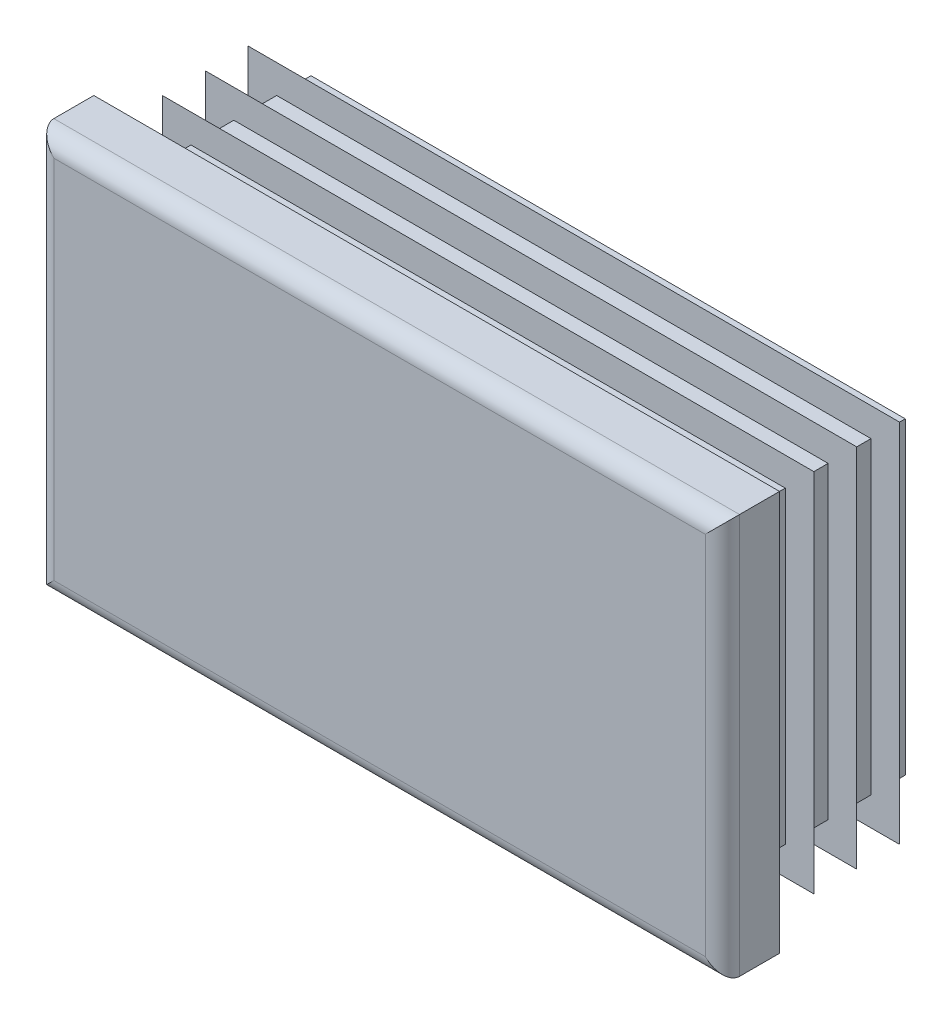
ISO-10303-21;
HEADER;
FILE_DESCRIPTION(('STEP AP214'),'2;1');
FILE_NAME('part.step','',(''),(''),'','','');
FILE_SCHEMA(('AUTOMOTIVE_DESIGN { 1 0 10303 214 1 1 1 1 }'));
ENDSEC;
DATA;
#1=APPLICATION_CONTEXT('core data for automotive mechanical design processes');
#2=APPLICATION_PROTOCOL_DEFINITION('international standard','automotive_design',2000,#1);
#3=PRODUCT_CONTEXT('',#1,'mechanical');
#4=PRODUCT('Part','Part','',(#3));
#5=PRODUCT_RELATED_PRODUCT_CATEGORY('part','',(#4));
#6=PRODUCT_DEFINITION_FORMATION('','',#4);
#7=PRODUCT_DEFINITION_CONTEXT('part definition',#1,'design');
#8=PRODUCT_DEFINITION('design','',#6,#7);
#9=PRODUCT_DEFINITION_SHAPE('','',#8);
#10=(LENGTH_UNIT() NAMED_UNIT(*) SI_UNIT(.MILLI.,.METRE.));
#11=(NAMED_UNIT(*) PLANE_ANGLE_UNIT() SI_UNIT($,.RADIAN.));
#12=(NAMED_UNIT(*) SI_UNIT($,.STERADIAN.) SOLID_ANGLE_UNIT());
#13=UNCERTAINTY_MEASURE_WITH_UNIT(LENGTH_MEASURE(1.E-05),#10,'distance_accuracy_value','');
#14=(GEOMETRIC_REPRESENTATION_CONTEXT(3) GLOBAL_UNCERTAINTY_ASSIGNED_CONTEXT((#13)) GLOBAL_UNIT_ASSIGNED_CONTEXT((#10,
#11,#12)) REPRESENTATION_CONTEXT('',''));
#15=CARTESIAN_POINT('',(0.,0.,0.));
#16=DIRECTION('',(0.,0.,1.));
#17=DIRECTION('',(1.,0.,0.));
#18=AXIS2_PLACEMENT_3D('',#15,#16,#17);
#19=CARTESIAN_POINT('',(28.5,-17.5,5.));
#20=DIRECTION('',(0.,0.,-1.));
#21=DIRECTION('',(0.,1.,0.));
#22=AXIS2_PLACEMENT_3D('',#19,#20,#21);
#23=PLANE('',#22);
#24=DIRECTION('',(0.,1.,0.));
#25=VECTOR('',#24,1.);
#26=CARTESIAN_POINT('',(-28.5,-17.5,5.));
#27=LINE('',#26,#25);
#28=CARTESIAN_POINT('',(-28.5,-16.,5.));
#29=VERTEX_POINT('',#28);
#30=CARTESIAN_POINT('',(-28.5,16.,5.));
#31=VERTEX_POINT('',#30);
#32=EDGE_CURVE('E310',#29,#31,#27,.T.);
#33=ORIENTED_EDGE('',*,*,#32,.F.);
#34=DIRECTION('',(-1.,0.,0.));
#35=VECTOR('',#34,1.);
#36=CARTESIAN_POINT('',(30.,-16.,5.));
#37=LINE('',#36,#35);
#38=CARTESIAN_POINT('',(28.5,-16.,5.));
#39=VERTEX_POINT('',#38);
#40=EDGE_CURVE('E482',#39,#29,#37,.T.);
#41=ORIENTED_EDGE('',*,*,#40,.F.);
#42=DIRECTION('',(0.,1.,0.));
#43=VECTOR('',#42,1.);
#44=CARTESIAN_POINT('',(28.5,-17.5,5.));
#45=LINE('',#44,#43);
#46=CARTESIAN_POINT('',(28.5,16.,5.));
#47=VERTEX_POINT('',#46);
#48=EDGE_CURVE('E305',#39,#47,#45,.T.);
#49=ORIENTED_EDGE('',*,*,#48,.T.);
#50=DIRECTION('',(-1.,0.,0.));
#51=VECTOR('',#50,1.);
#52=CARTESIAN_POINT('',(30.,16.,5.));
#53=LINE('',#52,#51);
#54=EDGE_CURVE('E630',#47,#31,#53,.T.);
#55=ORIENTED_EDGE('',*,*,#54,.T.);
#56=EDGE_LOOP('',(#33,#41,#49,#55));
#57=FACE_BOUND('',#56,.T.);
#58=ADVANCED_FACE('F14',(#57),#23,.F.);
#59=CARTESIAN_POINT('',(-28.5,-17.5,3.5));
#60=DIRECTION('',(0.,1.,0.));
#61=DIRECTION('',(-1.,0.,0.));
#62=AXIS2_PLACEMENT_3D('',#59,#60,#61);
#63=CYLINDRICAL_SURFACE('',#62,1.5);
#64=DIRECTION('',(0.,1.,0.));
#65=VECTOR('',#64,1.);
#66=CARTESIAN_POINT('',(-30.,-17.5,3.5));
#67=LINE('',#66,#65);
#68=CARTESIAN_POINT('',(-30.,-17.5,3.5));
#69=VERTEX_POINT('',#68);
#70=CARTESIAN_POINT('',(-30.,17.5,3.5));
#71=VERTEX_POINT('',#70);
#72=EDGE_CURVE('E402',#69,#71,#67,.T.);
#73=ORIENTED_EDGE('',*,*,#72,.F.);
#74=CARTESIAN_POINT('',(-28.5,-16.,3.5));
#75=DIRECTION('',(-0.707106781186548,0.707106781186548,0.));
#76=DIRECTION('',(0.707106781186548,0.707106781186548,0.));
#77=AXIS2_PLACEMENT_3D('',#74,#75,#76);
#78=ELLIPSE('',#77,2.12132034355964,1.5);
#79=EDGE_CURVE('E59',#69,#29,#78,.T.);
#80=ORIENTED_EDGE('',*,*,#79,.T.);
#81=ORIENTED_EDGE('',*,*,#32,.T.);
#82=CARTESIAN_POINT('',(-28.5,16.,3.5));
#83=DIRECTION('',(0.707106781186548,0.707106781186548,0.));
#84=DIRECTION('',(-0.707106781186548,0.707106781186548,0.));
#85=AXIS2_PLACEMENT_3D('',#82,#83,#84);
#86=ELLIPSE('',#85,2.12132034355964,1.5);
#87=EDGE_CURVE('E306',#31,#71,#86,.F.);
#88=ORIENTED_EDGE('',*,*,#87,.T.);
#89=EDGE_LOOP('',(#73,#80,#81,#88));
#90=FACE_BOUND('',#89,.T.);
#91=ADVANCED_FACE('F16',(#90),#63,.T.);
#92=CARTESIAN_POINT('',(-30.,-17.5,3.5));
#93=DIRECTION('',(1.,0.,0.));
#94=DIRECTION('',(0.,1.,0.));
#95=AXIS2_PLACEMENT_3D('',#92,#93,#94);
#96=PLANE('',#95);
#97=DIRECTION('',(0.,0.,-1.));
#98=VECTOR('',#97,1.);
#99=CARTESIAN_POINT('',(-30.,17.5,3.5));
#100=LINE('',#99,#98);
#101=CARTESIAN_POINT('',(-30.,17.5,0.));
#102=VERTEX_POINT('',#101);
#103=EDGE_CURVE('E615',#71,#102,#100,.T.);
#104=ORIENTED_EDGE('',*,*,#103,.T.);
#105=DIRECTION('',(0.,1.,0.));
#106=VECTOR('',#105,1.);
#107=CARTESIAN_POINT('',(-30.,-17.5,0.));
#108=LINE('',#107,#106);
#109=CARTESIAN_POINT('',(-30.,-17.5,0.));
#110=VERTEX_POINT('',#109);
#111=EDGE_CURVE('E400',#110,#102,#108,.T.);
#112=ORIENTED_EDGE('',*,*,#111,.F.);
#113=DIRECTION('',(0.,0.,-1.));
#114=VECTOR('',#113,1.);
#115=CARTESIAN_POINT('',(-30.,-17.5,3.5));
#116=LINE('',#115,#114);
#117=EDGE_CURVE('E616',#69,#110,#116,.T.);
#118=ORIENTED_EDGE('',*,*,#117,.F.);
#119=ORIENTED_EDGE('',*,*,#72,.T.);
#120=EDGE_LOOP('',(#104,#112,#118,#119));
#121=FACE_BOUND('',#120,.T.);
#122=ADVANCED_FACE('F697',(#121),#96,.F.);
#123=CARTESIAN_POINT('',(-26.,-17.5,0.));
#124=DIRECTION('',(1.,0.,0.));
#125=DIRECTION('',(0.,1.,0.));
#126=AXIS2_PLACEMENT_3D('',#123,#124,#125);
#127=PLANE('',#126);
#128=DIRECTION('',(0.,1.,0.));
#129=VECTOR('',#128,1.);
#130=CARTESIAN_POINT('',(-26.,-17.5,0.));
#131=LINE('',#130,#129);
#132=CARTESIAN_POINT('',(-26.,-13.5,0.));
#133=VERTEX_POINT('',#132);
#134=CARTESIAN_POINT('',(-26.,13.5,0.));
#135=VERTEX_POINT('',#134);
#136=EDGE_CURVE('E397',#133,#135,#131,.T.);
#137=ORIENTED_EDGE('',*,*,#136,.T.);
#138=DIRECTION('',(0.,0.,-1.));
#139=VECTOR('',#138,1.);
#140=CARTESIAN_POINT('',(-26.,13.5,0.));
#141=LINE('',#140,#139);
#142=CARTESIAN_POINT('',(-26.,13.5,-0.75));
#143=VERTEX_POINT('',#142);
#144=EDGE_CURVE('E495',#135,#143,#141,.T.);
#145=ORIENTED_EDGE('',*,*,#144,.T.);
#146=DIRECTION('',(0.,1.,0.));
#147=VECTOR('',#146,1.);
#148=CARTESIAN_POINT('',(-26.,-17.5,-0.75));
#149=LINE('',#148,#147);
#150=CARTESIAN_POINT('',(-26.,-13.5,-0.75));
#151=VERTEX_POINT('',#150);
#152=EDGE_CURVE('E394',#151,#143,#149,.T.);
#153=ORIENTED_EDGE('',*,*,#152,.F.);
#154=DIRECTION('',(0.,0.,1.));
#155=VECTOR('',#154,1.);
#156=CARTESIAN_POINT('',(-26.,-13.5,0.));
#157=LINE('',#156,#155);
#158=EDGE_CURVE('E489',#151,#133,#157,.T.);
#159=ORIENTED_EDGE('',*,*,#158,.T.);
#160=EDGE_LOOP('',(#137,#145,#153,#159));
#161=FACE_BOUND('',#160,.T.);
#162=ADVANCED_FACE('F787',(#161),#127,.F.);
#163=CARTESIAN_POINT('',(-28.5,-17.5,-0.75));
#164=DIRECTION('',(0.342020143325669,0.,0.939692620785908));
#165=DIRECTION('',(-0.939692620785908,0.,0.342020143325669));
#166=AXIS2_PLACEMENT_3D('',#163,#164,#165);
#167=PLANE('',#166);
#168=DIRECTION('',(0.,1.,0.));
#169=VECTOR('',#168,1.);
#170=CARTESIAN_POINT('',(-28.5,-17.5,-0.75));
#171=LINE('',#170,#169);
#172=CARTESIAN_POINT('',(-28.5,-16.,-0.75));
#173=VERTEX_POINT('',#172);
#174=CARTESIAN_POINT('',(-28.5,16.,-0.749999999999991));
#175=VERTEX_POINT('',#174);
#176=EDGE_CURVE('E392',#173,#175,#171,.T.);
#177=ORIENTED_EDGE('',*,*,#176,.T.);
#178=DIRECTION('',(0.844349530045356,-0.438895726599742,-0.307318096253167));
#179=VECTOR('',#178,1.);
#180=CARTESIAN_POINT('',(-16.0855230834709,9.54691312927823,-5.26850007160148));
#181=LINE('',#180,#179);
#182=CARTESIAN_POINT('',(-26.,14.7004915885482,-1.65992558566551));
#183=VERTEX_POINT('',#182);
#184=EDGE_CURVE('E519',#175,#183,#181,.T.);
#185=ORIENTED_EDGE('',*,*,#184,.T.);
#186=DIRECTION('',(0.,1.,0.));
#187=VECTOR('',#186,1.);
#188=CARTESIAN_POINT('',(-26.,-17.5,-1.65992558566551));
#189=LINE('',#188,#187);
#190=CARTESIAN_POINT('',(-26.,-14.7004915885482,-1.65992558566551));
#191=VERTEX_POINT('',#190);
#192=EDGE_CURVE('E389',#191,#183,#189,.T.);
#193=ORIENTED_EDGE('',*,*,#192,.F.);
#194=DIRECTION('',(-0.844349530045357,-0.438895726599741,0.307318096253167));
#195=VECTOR('',#194,1.);
#196=CARTESIAN_POINT('',(-29.0558721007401,-16.2889441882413,-0.547679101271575));
#197=LINE('',#196,#195);
#198=EDGE_CURVE('E507',#191,#173,#197,.T.);
#199=ORIENTED_EDGE('',*,*,#198,.T.);
#200=EDGE_LOOP('',(#177,#185,#193,#199));
#201=FACE_BOUND('',#200,.T.);
#202=ADVANCED_FACE('F783',(#201),#167,.F.);
#203=CARTESIAN_POINT('',(-26.,-17.5,-1.65992558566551));
#204=DIRECTION('',(1.,0.,0.));
#205=DIRECTION('',(0.,1.,0.));
#206=AXIS2_PLACEMENT_3D('',#203,#204,#205);
#207=PLANE('',#206);
#208=ORIENTED_EDGE('',*,*,#192,.T.);
#209=DIRECTION('',(0.,-0.819152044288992,-0.573576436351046));
#210=VECTOR('',#209,1.);
#211=CARTESIAN_POINT('',(-26.,-6.90636257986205,-16.7892077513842));
#212=LINE('',#211,#210);
#213=CARTESIAN_POINT('',(-26.,13.5,-2.50051884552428));
#214=VERTEX_POINT('',#213);
#215=EDGE_CURVE('E516',#183,#214,#212,.T.);
#216=ORIENTED_EDGE('',*,*,#215,.T.);
#217=DIRECTION('',(0.,0.,-1.));
#218=VECTOR('',#217,1.);
#219=CARTESIAN_POINT('',(-26.,13.5,-1.65992558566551));
#220=LINE('',#219,#218);
#221=CARTESIAN_POINT('',(-26.,13.5,-4.5));
#222=VERTEX_POINT('',#221);
#223=EDGE_CURVE('E525',#214,#222,#220,.T.);
#224=ORIENTED_EDGE('',*,*,#223,.T.);
#225=DIRECTION('',(0.,1.,0.));
#226=VECTOR('',#225,1.);
#227=CARTESIAN_POINT('',(-26.,-17.5,-4.5));
#228=LINE('',#227,#226);
#229=CARTESIAN_POINT('',(-26.,-13.5,-4.5));
#230=VERTEX_POINT('',#229);
#231=EDGE_CURVE('E386',#230,#222,#228,.T.);
#232=ORIENTED_EDGE('',*,*,#231,.F.);
#233=DIRECTION('',(0.,0.,1.));
#234=VECTOR('',#233,1.);
#235=CARTESIAN_POINT('',(-26.,-13.5,-1.65992558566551));
#236=LINE('',#235,#234);
#237=CARTESIAN_POINT('',(-26.,-13.5,-2.50051884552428));
#238=VERTEX_POINT('',#237);
#239=EDGE_CURVE('E522',#230,#238,#236,.T.);
#240=ORIENTED_EDGE('',*,*,#239,.T.);
#241=DIRECTION('',(0.,-0.819152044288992,0.573576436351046));
#242=VECTOR('',#241,1.);
#243=CARTESIAN_POINT('',(-26.,-16.5789899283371,-0.344586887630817));
#244=LINE('',#243,#242);
#245=EDGE_CURVE('E504',#238,#191,#244,.T.);
#246=ORIENTED_EDGE('',*,*,#245,.T.);
#247=EDGE_LOOP('',(#208,#216,#224,#232,#240,#246));
#248=FACE_BOUND('',#247,.T.);
#249=ADVANCED_FACE('F779',(#248),#207,.F.);
#250=CARTESIAN_POINT('',(-28.5,-17.5,-4.5));
#251=DIRECTION('',(0.342020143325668,0.,0.939692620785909));
#252=DIRECTION('',(-0.939692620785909,0.,0.342020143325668));
#253=AXIS2_PLACEMENT_3D('',#250,#251,#252);
#254=PLANE('',#253);
#255=DIRECTION('',(0.,1.,0.));
#256=VECTOR('',#255,1.);
#257=CARTESIAN_POINT('',(-28.5,-17.5,-4.5));
#258=LINE('',#257,#256);
#259=CARTESIAN_POINT('',(-28.5,-16.,-4.5));
#260=VERTEX_POINT('',#259);
#261=CARTESIAN_POINT('',(-28.5,16.,-4.5));
#262=VERTEX_POINT('',#261);
#263=EDGE_CURVE('E384',#260,#262,#258,.T.);
#264=ORIENTED_EDGE('',*,*,#263,.T.);
#265=DIRECTION('',(0.844349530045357,-0.43889572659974,-0.307318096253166));
#266=VECTOR('',#265,1.);
#267=CARTESIAN_POINT('',(-16.0855230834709,9.54691312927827,-9.01850007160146));
#268=LINE('',#267,#266);
#269=CARTESIAN_POINT('',(-26.,14.7004915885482,-5.4099255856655));
#270=VERTEX_POINT('',#269);
#271=EDGE_CURVE('E549',#262,#270,#268,.T.);
#272=ORIENTED_EDGE('',*,*,#271,.T.);
#273=DIRECTION('',(0.,1.,0.));
#274=VECTOR('',#273,1.);
#275=CARTESIAN_POINT('',(-26.,-17.5,-5.4099255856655));
#276=LINE('',#275,#274);
#277=CARTESIAN_POINT('',(-26.,-14.7004915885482,-5.4099255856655));
#278=VERTEX_POINT('',#277);
#279=EDGE_CURVE('E381',#278,#270,#276,.T.);
#280=ORIENTED_EDGE('',*,*,#279,.F.);
#281=DIRECTION('',(-0.844349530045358,-0.43889572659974,0.307318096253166));
#282=VECTOR('',#281,1.);
#283=CARTESIAN_POINT('',(-29.0558721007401,-16.2889441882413,-4.29767910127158));
#284=LINE('',#283,#282);
#285=EDGE_CURVE('E537',#278,#260,#284,.T.);
#286=ORIENTED_EDGE('',*,*,#285,.T.);
#287=EDGE_LOOP('',(#264,#272,#280,#286));
#288=FACE_BOUND('',#287,.T.);
#289=ADVANCED_FACE('F775',(#288),#254,.F.);
#290=CARTESIAN_POINT('',(-26.,-17.5,-5.4099255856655));
#291=DIRECTION('',(1.,0.,0.));
#292=DIRECTION('',(0.,1.,0.));
#293=AXIS2_PLACEMENT_3D('',#290,#291,#292);
#294=PLANE('',#293);
#295=ORIENTED_EDGE('',*,*,#279,.T.);
#296=DIRECTION('',(0.,-0.819152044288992,-0.573576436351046));
#297=VECTOR('',#296,1.);
#298=CARTESIAN_POINT('',(-26.,-6.90636257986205,-20.5392077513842));
#299=LINE('',#298,#297);
#300=CARTESIAN_POINT('',(-26.,13.5,-6.25051884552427));
#301=VERTEX_POINT('',#300);
#302=EDGE_CURVE('E546',#270,#301,#299,.T.);
#303=ORIENTED_EDGE('',*,*,#302,.T.);
#304=DIRECTION('',(0.,0.,-1.));
#305=VECTOR('',#304,1.);
#306=CARTESIAN_POINT('',(-26.,13.5,-5.4099255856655));
#307=LINE('',#306,#305);
#308=CARTESIAN_POINT('',(-26.,13.5,-8.25));
#309=VERTEX_POINT('',#308);
#310=EDGE_CURVE('E555',#301,#309,#307,.T.);
#311=ORIENTED_EDGE('',*,*,#310,.T.);
#312=DIRECTION('',(0.,1.,0.));
#313=VECTOR('',#312,1.);
#314=CARTESIAN_POINT('',(-26.,-17.5,-8.25));
#315=LINE('',#314,#313);
#316=CARTESIAN_POINT('',(-26.,-13.5,-8.25));
#317=VERTEX_POINT('',#316);
#318=EDGE_CURVE('E378',#317,#309,#315,.T.);
#319=ORIENTED_EDGE('',*,*,#318,.F.);
#320=DIRECTION('',(0.,0.,1.));
#321=VECTOR('',#320,1.);
#322=CARTESIAN_POINT('',(-26.,-13.5,-5.4099255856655));
#323=LINE('',#322,#321);
#324=CARTESIAN_POINT('',(-26.,-13.5,-6.25051884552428));
#325=VERTEX_POINT('',#324);
#326=EDGE_CURVE('E552',#317,#325,#323,.T.);
#327=ORIENTED_EDGE('',*,*,#326,.T.);
#328=DIRECTION('',(0.,-0.819152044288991,0.573576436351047));
#329=VECTOR('',#328,1.);
#330=CARTESIAN_POINT('',(-26.,-16.5789899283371,-4.09458688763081));
#331=LINE('',#330,#329);
#332=EDGE_CURVE('E534',#325,#278,#331,.T.);
#333=ORIENTED_EDGE('',*,*,#332,.T.);
#334=EDGE_LOOP('',(#295,#303,#311,#319,#327,#333));
#335=FACE_BOUND('',#334,.T.);
#336=ADVANCED_FACE('F771',(#335),#294,.F.);
#337=CARTESIAN_POINT('',(-28.5,-17.5,-8.25));
#338=DIRECTION('',(0.342020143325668,0.,0.939692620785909));
#339=DIRECTION('',(-0.939692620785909,0.,0.342020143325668));
#340=AXIS2_PLACEMENT_3D('',#337,#338,#339);
#341=PLANE('',#340);
#342=DIRECTION('',(0.,1.,0.));
#343=VECTOR('',#342,1.);
#344=CARTESIAN_POINT('',(-28.5,-17.5,-8.25));
#345=LINE('',#344,#343);
#346=CARTESIAN_POINT('',(-28.5,-16.,-8.25));
#347=VERTEX_POINT('',#346);
#348=CARTESIAN_POINT('',(-28.5,16.,-8.25));
#349=VERTEX_POINT('',#348);
#350=EDGE_CURVE('E376',#347,#349,#345,.T.);
#351=ORIENTED_EDGE('',*,*,#350,.T.);
#352=DIRECTION('',(0.844349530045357,-0.438895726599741,-0.307318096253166));
#353=VECTOR('',#352,1.);
#354=CARTESIAN_POINT('',(-16.0855230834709,9.54691312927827,-12.7685000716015));
#355=LINE('',#354,#353);
#356=CARTESIAN_POINT('',(-26.,14.7004915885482,-9.1599255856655));
#357=VERTEX_POINT('',#356);
#358=EDGE_CURVE('E579',#349,#357,#355,.T.);
#359=ORIENTED_EDGE('',*,*,#358,.T.);
#360=DIRECTION('',(0.,1.,0.));
#361=VECTOR('',#360,1.);
#362=CARTESIAN_POINT('',(-26.,-17.5,-9.1599255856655));
#363=LINE('',#362,#361);
#364=CARTESIAN_POINT('',(-26.,-14.7004915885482,-9.1599255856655));
#365=VERTEX_POINT('',#364);
#366=EDGE_CURVE('E373',#365,#357,#363,.T.);
#367=ORIENTED_EDGE('',*,*,#366,.F.);
#368=DIRECTION('',(-0.844349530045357,-0.43889572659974,0.307318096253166));
#369=VECTOR('',#368,1.);
#370=CARTESIAN_POINT('',(-29.0558721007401,-16.2889441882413,-8.04767910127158));
#371=LINE('',#370,#369);
#372=EDGE_CURVE('E567',#365,#347,#371,.T.);
#373=ORIENTED_EDGE('',*,*,#372,.T.);
#374=EDGE_LOOP('',(#351,#359,#367,#373));
#375=FACE_BOUND('',#374,.T.);
#376=ADVANCED_FACE('F767',(#375),#341,.F.);
#377=CARTESIAN_POINT('',(-26.,-17.5,-9.1599255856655));
#378=DIRECTION('',(1.,0.,0.));
#379=DIRECTION('',(0.,1.,0.));
#380=AXIS2_PLACEMENT_3D('',#377,#378,#379);
#381=PLANE('',#380);
#382=ORIENTED_EDGE('',*,*,#366,.T.);
#383=DIRECTION('',(0.,-0.819152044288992,-0.573576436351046));
#384=VECTOR('',#383,1.);
#385=CARTESIAN_POINT('',(-26.,-6.90636257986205,-24.2892077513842));
#386=LINE('',#385,#384);
#387=CARTESIAN_POINT('',(-26.,13.5,-10.0005188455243));
#388=VERTEX_POINT('',#387);
#389=EDGE_CURVE('E576',#357,#388,#386,.T.);
#390=ORIENTED_EDGE('',*,*,#389,.T.);
#391=DIRECTION('',(0.,0.,-1.));
#392=VECTOR('',#391,1.);
#393=CARTESIAN_POINT('',(-26.,13.5,-9.1599255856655));
#394=LINE('',#393,#392);
#395=CARTESIAN_POINT('',(-26.,13.5,-12.));
#396=VERTEX_POINT('',#395);
#397=EDGE_CURVE('E585',#388,#396,#394,.T.);
#398=ORIENTED_EDGE('',*,*,#397,.T.);
#399=DIRECTION('',(0.,1.,0.));
#400=VECTOR('',#399,1.);
#401=CARTESIAN_POINT('',(-26.,-17.5,-12.));
#402=LINE('',#401,#400);
#403=CARTESIAN_POINT('',(-26.,-13.5,-12.));
#404=VERTEX_POINT('',#403);
#405=EDGE_CURVE('E370',#404,#396,#402,.T.);
#406=ORIENTED_EDGE('',*,*,#405,.F.);
#407=DIRECTION('',(0.,0.,1.));
#408=VECTOR('',#407,1.);
#409=CARTESIAN_POINT('',(-26.,-13.5,-9.1599255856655));
#410=LINE('',#409,#408);
#411=CARTESIAN_POINT('',(-26.,-13.5,-10.0005188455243));
#412=VERTEX_POINT('',#411);
#413=EDGE_CURVE('E582',#404,#412,#410,.T.);
#414=ORIENTED_EDGE('',*,*,#413,.T.);
#415=DIRECTION('',(0.,-0.819152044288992,0.573576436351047));
#416=VECTOR('',#415,1.);
#417=CARTESIAN_POINT('',(-26.,-16.5789899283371,-7.84458688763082));
#418=LINE('',#417,#416);
#419=EDGE_CURVE('E564',#412,#365,#418,.T.);
#420=ORIENTED_EDGE('',*,*,#419,.T.);
#421=EDGE_LOOP('',(#382,#390,#398,#406,#414,#420));
#422=FACE_BOUND('',#421,.T.);
#423=ADVANCED_FACE('F764',(#422),#381,.F.);
#424=CARTESIAN_POINT('',(-28.5,-17.5,-12.));
#425=DIRECTION('',(0.342020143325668,0.,0.939692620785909));
#426=DIRECTION('',(-0.939692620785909,0.,0.342020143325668));
#427=AXIS2_PLACEMENT_3D('',#424,#425,#426);
#428=PLANE('',#427);
#429=DIRECTION('',(0.,1.,0.));
#430=VECTOR('',#429,1.);
#431=CARTESIAN_POINT('',(-28.5,-17.5,-12.));
#432=LINE('',#431,#430);
#433=CARTESIAN_POINT('',(-28.5,-16.,-12.));
#434=VERTEX_POINT('',#433);
#435=CARTESIAN_POINT('',(-28.5,16.,-12.));
#436=VERTEX_POINT('',#435);
#437=EDGE_CURVE('E368',#434,#436,#432,.T.);
#438=ORIENTED_EDGE('',*,*,#437,.T.);
#439=DIRECTION('',(0.844349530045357,-0.438895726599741,-0.307318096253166));
#440=VECTOR('',#439,1.);
#441=CARTESIAN_POINT('',(-16.0855230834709,9.54691312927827,-16.5185000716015));
#442=LINE('',#441,#440);
#443=CARTESIAN_POINT('',(-26.,14.7004915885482,-12.9099255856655));
#444=VERTEX_POINT('',#443);
#445=EDGE_CURVE('E607',#436,#444,#442,.T.);
#446=ORIENTED_EDGE('',*,*,#445,.T.);
#447=DIRECTION('',(0.,1.,0.));
#448=VECTOR('',#447,1.);
#449=CARTESIAN_POINT('',(-26.,-17.5,-12.9099255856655));
#450=LINE('',#449,#448);
#451=CARTESIAN_POINT('',(-26.,-14.7004915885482,-12.9099255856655));
#452=VERTEX_POINT('',#451);
#453=EDGE_CURVE('E365',#452,#444,#450,.T.);
#454=ORIENTED_EDGE('',*,*,#453,.F.);
#455=DIRECTION('',(-0.844349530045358,-0.43889572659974,0.307318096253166));
#456=VECTOR('',#455,1.);
#457=CARTESIAN_POINT('',(-29.0558721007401,-16.2889441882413,-11.7976791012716));
#458=LINE('',#457,#456);
#459=EDGE_CURVE('E595',#452,#434,#458,.T.);
#460=ORIENTED_EDGE('',*,*,#459,.T.);
#461=EDGE_LOOP('',(#438,#446,#454,#460));
#462=FACE_BOUND('',#461,.T.);
#463=ADVANCED_FACE('F675',(#462),#428,.F.);
#464=CARTESIAN_POINT('',(-26.,-17.5,-12.9099255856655));
#465=DIRECTION('',(1.,0.,0.));
#466=DIRECTION('',(0.,1.,0.));
#467=AXIS2_PLACEMENT_3D('',#464,#465,#466);
#468=PLANE('',#467);
#469=ORIENTED_EDGE('',*,*,#453,.T.);
#470=DIRECTION('',(0.,-0.819152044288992,-0.573576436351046));
#471=VECTOR('',#470,1.);
#472=CARTESIAN_POINT('',(-26.,-6.90636257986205,-28.0392077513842));
#473=LINE('',#472,#471);
#474=CARTESIAN_POINT('',(-26.,13.5,-13.7505188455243));
#475=VERTEX_POINT('',#474);
#476=EDGE_CURVE('E604',#444,#475,#473,.T.);
#477=ORIENTED_EDGE('',*,*,#476,.T.);
#478=DIRECTION('',(0.,0.,-1.));
#479=VECTOR('',#478,1.);
#480=CARTESIAN_POINT('',(-26.,13.5,-12.9099255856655));
#481=LINE('',#480,#479);
#482=CARTESIAN_POINT('',(-26.,13.5,-15.));
#483=VERTEX_POINT('',#482);
#484=EDGE_CURVE('E613',#475,#483,#481,.T.);
#485=ORIENTED_EDGE('',*,*,#484,.T.);
#486=DIRECTION('',(0.,1.,0.));
#487=VECTOR('',#486,1.);
#488=CARTESIAN_POINT('',(-26.,-17.5,-15.));
#489=LINE('',#488,#487);
#490=CARTESIAN_POINT('',(-26.,-13.5,-15.));
#491=VERTEX_POINT('',#490);
#492=EDGE_CURVE('E362',#491,#483,#489,.T.);
#493=ORIENTED_EDGE('',*,*,#492,.F.);
#494=DIRECTION('',(0.,0.,1.));
#495=VECTOR('',#494,1.);
#496=CARTESIAN_POINT('',(-26.,-13.5,-12.9099255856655));
#497=LINE('',#496,#495);
#498=CARTESIAN_POINT('',(-26.,-13.5,-13.7505188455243));
#499=VERTEX_POINT('',#498);
#500=EDGE_CURVE('E610',#491,#499,#497,.T.);
#501=ORIENTED_EDGE('',*,*,#500,.T.);
#502=DIRECTION('',(0.,-0.819152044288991,0.573576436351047));
#503=VECTOR('',#502,1.);
#504=CARTESIAN_POINT('',(-26.,-16.5789899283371,-11.5945868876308));
#505=LINE('',#504,#503);
#506=EDGE_CURVE('E592',#499,#452,#505,.T.);
#507=ORIENTED_EDGE('',*,*,#506,.T.);
#508=EDGE_LOOP('',(#469,#477,#485,#493,#501,#507));
#509=FACE_BOUND('',#508,.T.);
#510=ADVANCED_FACE('F677',(#509),#468,.F.);
#511=CARTESIAN_POINT('',(-26.,-17.5,-15.));
#512=DIRECTION('',(0.,0.,1.));
#513=DIRECTION('',(0.,-1.,0.));
#514=AXIS2_PLACEMENT_3D('',#511,#512,#513);
#515=PLANE('',#514);
#516=ORIENTED_EDGE('',*,*,#492,.T.);
#517=DIRECTION('',(-1.,0.,0.));
#518=VECTOR('',#517,1.);
#519=CARTESIAN_POINT('',(30.,13.5,-15.));
#520=LINE('',#519,#518);
#521=CARTESIAN_POINT('',(26.,13.5,-15.));
#522=VERTEX_POINT('',#521);
#523=EDGE_CURVE('E438',#522,#483,#520,.T.);
#524=ORIENTED_EDGE('',*,*,#523,.F.);
#525=DIRECTION('',(0.,1.,0.));
#526=VECTOR('',#525,1.);
#527=CARTESIAN_POINT('',(26.,-17.5,-15.));
#528=LINE('',#527,#526);
#529=CARTESIAN_POINT('',(26.,-13.5,-15.));
#530=VERTEX_POINT('',#529);
#531=EDGE_CURVE('E359',#530,#522,#528,.T.);
#532=ORIENTED_EDGE('',*,*,#531,.F.);
#533=DIRECTION('',(-1.,0.,0.));
#534=VECTOR('',#533,1.);
#535=CARTESIAN_POINT('',(30.,-13.5,-15.));
#536=LINE('',#535,#534);
#537=EDGE_CURVE('E436',#530,#491,#536,.T.);
#538=ORIENTED_EDGE('',*,*,#537,.T.);
#539=EDGE_LOOP('',(#516,#524,#532,#538));
#540=FACE_BOUND('',#539,.T.);
#541=ADVANCED_FACE('F435',(#540),#515,.F.);
#542=CARTESIAN_POINT('',(26.,-17.5,-15.));
#543=DIRECTION('',(-1.,0.,0.));
#544=DIRECTION('',(0.,-1.,0.));
#545=AXIS2_PLACEMENT_3D('',#542,#543,#544);
#546=PLANE('',#545);
#547=DIRECTION('',(0.,0.,1.));
#548=VECTOR('',#547,1.);
#549=CARTESIAN_POINT('',(26.,13.5,-15.));
#550=LINE('',#549,#548);
#551=CARTESIAN_POINT('',(26.,13.5,-13.7505188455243));
#552=VERTEX_POINT('',#551);
#553=EDGE_CURVE('E9',#522,#552,#550,.T.);
#554=ORIENTED_EDGE('',*,*,#553,.T.);
#555=DIRECTION('',(0.,0.819152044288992,0.573576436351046));
#556=VECTOR('',#555,1.);
#557=CARTESIAN_POINT('',(26.,-7.88837633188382,-28.7268211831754));
#558=LINE('',#557,#556);
#559=CARTESIAN_POINT('',(26.,14.7004915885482,-12.9099255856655));
#560=VERTEX_POINT('',#559);
#561=EDGE_CURVE('E601',#552,#560,#558,.T.);
#562=ORIENTED_EDGE('',*,*,#561,.T.);
#563=DIRECTION('',(0.,1.,0.));
#564=VECTOR('',#563,1.);
#565=CARTESIAN_POINT('',(26.,-17.5,-12.9099255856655));
#566=LINE('',#565,#564);
#567=CARTESIAN_POINT('',(26.,-14.7004915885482,-12.9099255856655));
#568=VERTEX_POINT('',#567);
#569=EDGE_CURVE('E356',#568,#560,#566,.T.);
#570=ORIENTED_EDGE('',*,*,#569,.F.);
#571=DIRECTION('',(0.,0.819152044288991,-0.573576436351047));
#572=VECTOR('',#571,1.);
#573=CARTESIAN_POINT('',(26.,-15.5969761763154,-12.2822003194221));
#574=LINE('',#573,#572);
#575=CARTESIAN_POINT('',(26.,-13.5,-13.7505188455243));
#576=VERTEX_POINT('',#575);
#577=EDGE_CURVE('E428',#568,#576,#574,.T.);
#578=ORIENTED_EDGE('',*,*,#577,.T.);
#579=DIRECTION('',(0.,0.,-1.));
#580=VECTOR('',#579,1.);
#581=CARTESIAN_POINT('',(26.,-13.5,-15.));
#582=LINE('',#581,#580);
#583=EDGE_CURVE('E23',#576,#530,#582,.T.);
#584=ORIENTED_EDGE('',*,*,#583,.T.);
#585=ORIENTED_EDGE('',*,*,#531,.T.);
#586=EDGE_LOOP('',(#554,#562,#570,#578,#584,#585));
#587=FACE_BOUND('',#586,.T.);
#588=ADVANCED_FACE('F426',(#587),#546,.F.);
#589=CARTESIAN_POINT('',(26.,-17.5,-12.9099255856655));
#590=DIRECTION('',(-0.342020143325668,0.,0.939692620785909));
#591=DIRECTION('',(-0.939692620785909,0.,-0.342020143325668));
#592=AXIS2_PLACEMENT_3D('',#589,#590,#591);
#593=PLANE('',#592);
#594=ORIENTED_EDGE('',*,*,#569,.T.);
#595=DIRECTION('',(0.844349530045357,0.438895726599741,0.307318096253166));
#596=VECTOR('',#595,1.);
#597=CARTESIAN_POINT('',(14.0670967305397,8.49772831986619,-17.2531471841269));
#598=LINE('',#597,#596);
#599=CARTESIAN_POINT('',(28.5,16.,-12.));
#600=VERTEX_POINT('',#599);
#601=EDGE_CURVE('E598',#560,#600,#598,.T.);
#602=ORIENTED_EDGE('',*,*,#601,.T.);
#603=DIRECTION('',(0.,1.,0.));
#604=VECTOR('',#603,1.);
#605=CARTESIAN_POINT('',(28.5,-17.5,-12.));
#606=LINE('',#605,#604);
#607=CARTESIAN_POINT('',(28.5,-16.,-12.));
#608=VERTEX_POINT('',#607);
#609=EDGE_CURVE('E353',#608,#600,#606,.T.);
#610=ORIENTED_EDGE('',*,*,#609,.F.);
#611=DIRECTION('',(-0.844349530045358,0.43889572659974,-0.307318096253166));
#612=VECTOR('',#611,1.);
#613=CARTESIAN_POINT('',(27.0374457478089,-15.2397593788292,-12.532326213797));
#614=LINE('',#613,#612);
#615=EDGE_CURVE('E588',#608,#568,#614,.T.);
#616=ORIENTED_EDGE('',*,*,#615,.T.);
#617=EDGE_LOOP('',(#594,#602,#610,#616));
#618=FACE_BOUND('',#617,.T.);
#619=ADVANCED_FACE('F752',(#618),#593,.F.);
#620=CARTESIAN_POINT('',(28.5,-17.5,-12.));
#621=DIRECTION('',(0.,0.,-1.));
#622=DIRECTION('',(0.,1.,0.));
#623=AXIS2_PLACEMENT_3D('',#620,#621,#622);
#624=PLANE('',#623);
#625=ORIENTED_EDGE('',*,*,#609,.T.);
#626=DIRECTION('',(-1.,0.,0.));
#627=VECTOR('',#626,1.);
#628=CARTESIAN_POINT('',(30.,16.,-12.));
#629=LINE('',#628,#627);
#630=EDGE_CURVE('E444',#600,#436,#629,.T.);
#631=ORIENTED_EDGE('',*,*,#630,.T.);
#632=ORIENTED_EDGE('',*,*,#437,.F.);
#633=DIRECTION('',(-1.,0.,0.));
#634=VECTOR('',#633,1.);
#635=CARTESIAN_POINT('',(30.,-16.,-12.));
#636=LINE('',#635,#634);
#637=EDGE_CURVE('E451',#608,#434,#636,.T.);
#638=ORIENTED_EDGE('',*,*,#637,.F.);
#639=EDGE_LOOP('',(#625,#631,#632,#638));
#640=FACE_BOUND('',#639,.T.);
#641=ORIENTED_EDGE('',*,*,#405,.T.);
#642=DIRECTION('',(-1.,0.,0.));
#643=VECTOR('',#642,1.);
#644=CARTESIAN_POINT('',(30.,13.5,-12.));
#645=LINE('',#644,#643);
#646=CARTESIAN_POINT('',(26.,13.5,-12.));
#647=VERTEX_POINT('',#646);
#648=EDGE_CURVE('E663',#647,#396,#645,.T.);
#649=ORIENTED_EDGE('',*,*,#648,.F.);
#650=DIRECTION('',(0.,1.,0.));
#651=VECTOR('',#650,1.);
#652=CARTESIAN_POINT('',(26.,-17.5,-12.));
#653=LINE('',#652,#651);
#654=CARTESIAN_POINT('',(26.,-13.5,-12.));
#655=VERTEX_POINT('',#654);
#656=EDGE_CURVE('E350',#655,#647,#653,.T.);
#657=ORIENTED_EDGE('',*,*,#656,.F.);
#658=DIRECTION('',(-1.,0.,0.));
#659=VECTOR('',#658,1.);
#660=CARTESIAN_POINT('',(30.,-13.5,-12.));
#661=LINE('',#660,#659);
#662=EDGE_CURVE('E453',#655,#404,#661,.T.);
#663=ORIENTED_EDGE('',*,*,#662,.T.);
#664=EDGE_LOOP('',(#641,#649,#657,#663));
#665=FACE_BOUND('',#664,.T.);
#666=ADVANCED_FACE('F667',(#640,#665),#624,.F.);
#667=CARTESIAN_POINT('',(26.,-17.5,-12.));
#668=DIRECTION('',(-1.,0.,0.));
#669=DIRECTION('',(0.,-1.,0.));
#670=AXIS2_PLACEMENT_3D('',#667,#668,#669);
#671=PLANE('',#670);
#672=DIRECTION('',(0.,0.,1.));
#673=VECTOR('',#672,1.);
#674=CARTESIAN_POINT('',(26.,13.5,-12.));
#675=LINE('',#674,#673);
#676=CARTESIAN_POINT('',(26.,13.5,-10.0005188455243));
#677=VERTEX_POINT('',#676);
#678=EDGE_CURVE('E420',#647,#677,#675,.T.);
#679=ORIENTED_EDGE('',*,*,#678,.T.);
#680=DIRECTION('',(0.,0.819152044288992,0.573576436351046));
#681=VECTOR('',#680,1.);
#682=CARTESIAN_POINT('',(26.,-8.24076106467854,-25.2235636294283));
#683=LINE('',#682,#681);
#684=CARTESIAN_POINT('',(26.,14.7004915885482,-9.1599255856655));
#685=VERTEX_POINT('',#684);
#686=EDGE_CURVE('E573',#677,#685,#683,.T.);
#687=ORIENTED_EDGE('',*,*,#686,.T.);
#688=DIRECTION('',(0.,1.,0.));
#689=VECTOR('',#688,1.);
#690=CARTESIAN_POINT('',(26.,-17.5,-9.1599255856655));
#691=LINE('',#690,#689);
#692=CARTESIAN_POINT('',(26.,-14.7004915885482,-9.15992558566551));
#693=VERTEX_POINT('',#692);
#694=EDGE_CURVE('E347',#693,#685,#691,.T.);
#695=ORIENTED_EDGE('',*,*,#694,.F.);
#696=DIRECTION('',(0.,0.819152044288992,-0.573576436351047));
#697=VECTOR('',#696,1.);
#698=CARTESIAN_POINT('',(26.,-15.2445914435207,-8.77894276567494));
#699=LINE('',#698,#697);
#700=CARTESIAN_POINT('',(26.,-13.5,-10.0005188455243));
#701=VERTEX_POINT('',#700);
#702=EDGE_CURVE('E561',#693,#701,#699,.T.);
#703=ORIENTED_EDGE('',*,*,#702,.T.);
#704=DIRECTION('',(0.,0.,-1.));
#705=VECTOR('',#704,1.);
#706=CARTESIAN_POINT('',(26.,-13.5,-12.));
#707=LINE('',#706,#705);
#708=EDGE_CURVE('E417',#701,#655,#707,.T.);
#709=ORIENTED_EDGE('',*,*,#708,.T.);
#710=ORIENTED_EDGE('',*,*,#656,.T.);
#711=EDGE_LOOP('',(#679,#687,#695,#703,#709,#710));
#712=FACE_BOUND('',#711,.T.);
#713=ADVANCED_FACE('F745',(#712),#671,.F.);
#714=CARTESIAN_POINT('',(26.,-17.5,-9.1599255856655));
#715=DIRECTION('',(-0.342020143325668,0.,0.939692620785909));
#716=DIRECTION('',(-0.939692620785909,0.,-0.342020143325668));
#717=AXIS2_PLACEMENT_3D('',#714,#715,#716);
#718=PLANE('',#717);
#719=ORIENTED_EDGE('',*,*,#694,.T.);
#720=DIRECTION('',(0.844349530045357,0.438895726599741,0.307318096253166));
#721=VECTOR('',#720,1.);
#722=CARTESIAN_POINT('',(14.0670967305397,8.49772831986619,-13.5031471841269));
#723=LINE('',#722,#721);
#724=CARTESIAN_POINT('',(28.5,16.,-8.25));
#725=VERTEX_POINT('',#724);
#726=EDGE_CURVE('E570',#685,#725,#723,.T.);
#727=ORIENTED_EDGE('',*,*,#726,.T.);
#728=DIRECTION('',(0.,1.,0.));
#729=VECTOR('',#728,1.);
#730=CARTESIAN_POINT('',(28.5,-17.5,-8.25));
#731=LINE('',#730,#729);
#732=CARTESIAN_POINT('',(28.5,-16.,-8.25));
#733=VERTEX_POINT('',#732);
#734=EDGE_CURVE('E344',#733,#725,#731,.T.);
#735=ORIENTED_EDGE('',*,*,#734,.F.);
#736=DIRECTION('',(-0.844349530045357,0.43889572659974,-0.307318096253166));
#737=VECTOR('',#736,1.);
#738=CARTESIAN_POINT('',(27.0374457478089,-15.2397593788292,-8.78232621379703));
#739=LINE('',#738,#737);
#740=EDGE_CURVE('E558',#733,#693,#739,.T.);
#741=ORIENTED_EDGE('',*,*,#740,.T.);
#742=EDGE_LOOP('',(#719,#727,#735,#741));
#743=FACE_BOUND('',#742,.T.);
#744=ADVANCED_FACE('F741',(#743),#718,.F.);
#745=CARTESIAN_POINT('',(28.5,-17.5,-8.25));
#746=DIRECTION('',(0.,0.,-1.));
#747=DIRECTION('',(0.,1.,0.));
#748=AXIS2_PLACEMENT_3D('',#745,#746,#747);
#749=PLANE('',#748);
#750=ORIENTED_EDGE('',*,*,#734,.T.);
#751=DIRECTION('',(-1.,0.,0.));
#752=VECTOR('',#751,1.);
#753=CARTESIAN_POINT('',(30.,16.,-8.25));
#754=LINE('',#753,#752);
#755=EDGE_CURVE('E657',#725,#349,#754,.T.);
#756=ORIENTED_EDGE('',*,*,#755,.T.);
#757=ORIENTED_EDGE('',*,*,#350,.F.);
#758=DIRECTION('',(-1.,0.,0.));
#759=VECTOR('',#758,1.);
#760=CARTESIAN_POINT('',(30.,-16.,-8.25));
#761=LINE('',#760,#759);
#762=EDGE_CURVE('E459',#733,#347,#761,.T.);
#763=ORIENTED_EDGE('',*,*,#762,.F.);
#764=EDGE_LOOP('',(#750,#756,#757,#763));
#765=FACE_BOUND('',#764,.T.);
#766=ORIENTED_EDGE('',*,*,#318,.T.);
#767=DIRECTION('',(-1.,0.,0.));
#768=VECTOR('',#767,1.);
#769=CARTESIAN_POINT('',(30.,13.5,-8.25));
#770=LINE('',#769,#768);
#771=CARTESIAN_POINT('',(26.,13.5,-8.25));
#772=VERTEX_POINT('',#771);
#773=EDGE_CURVE('E655',#772,#309,#770,.T.);
#774=ORIENTED_EDGE('',*,*,#773,.F.);
#775=DIRECTION('',(0.,1.,0.));
#776=VECTOR('',#775,1.);
#777=CARTESIAN_POINT('',(26.,-17.5,-8.25));
#778=LINE('',#777,#776);
#779=CARTESIAN_POINT('',(26.,-13.5,-8.25));
#780=VERTEX_POINT('',#779);
#781=EDGE_CURVE('E341',#780,#772,#778,.T.);
#782=ORIENTED_EDGE('',*,*,#781,.F.);
#783=DIRECTION('',(-1.,0.,0.));
#784=VECTOR('',#783,1.);
#785=CARTESIAN_POINT('',(30.,-13.5,-8.25));
#786=LINE('',#785,#784);
#787=EDGE_CURVE('E461',#780,#317,#786,.T.);
#788=ORIENTED_EDGE('',*,*,#787,.T.);
#789=EDGE_LOOP('',(#766,#774,#782,#788));
#790=FACE_BOUND('',#789,.T.);
#791=ADVANCED_FACE('F737',(#765,#790),#749,.F.);
#792=CARTESIAN_POINT('',(26.,-17.5,-8.25));
#793=DIRECTION('',(-1.,0.,0.));
#794=DIRECTION('',(0.,-1.,0.));
#795=AXIS2_PLACEMENT_3D('',#792,#793,#794);
#796=PLANE('',#795);
#797=DIRECTION('',(0.,0.,1.));
#798=VECTOR('',#797,1.);
#799=CARTESIAN_POINT('',(26.,13.5,-8.25));
#800=LINE('',#799,#798);
#801=CARTESIAN_POINT('',(26.,13.5,-6.25051884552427));
#802=VERTEX_POINT('',#801);
#803=EDGE_CURVE('E414',#772,#802,#800,.T.);
#804=ORIENTED_EDGE('',*,*,#803,.T.);
#805=DIRECTION('',(0.,0.819152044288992,0.573576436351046));
#806=VECTOR('',#805,1.);
#807=CARTESIAN_POINT('',(26.,-8.24076106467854,-21.4735636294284));
#808=LINE('',#807,#806);
#809=CARTESIAN_POINT('',(26.,14.7004915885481,-5.40992558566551));
#810=VERTEX_POINT('',#809);
#811=EDGE_CURVE('E543',#802,#810,#808,.T.);
#812=ORIENTED_EDGE('',*,*,#811,.T.);
#813=DIRECTION('',(0.,1.,0.));
#814=VECTOR('',#813,1.);
#815=CARTESIAN_POINT('',(26.,-17.5,-5.40992558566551));
#816=LINE('',#815,#814);
#817=CARTESIAN_POINT('',(26.,-14.7004915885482,-5.40992558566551));
#818=VERTEX_POINT('',#817);
#819=EDGE_CURVE('E338',#818,#810,#816,.T.);
#820=ORIENTED_EDGE('',*,*,#819,.F.);
#821=DIRECTION('',(0.,0.819152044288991,-0.573576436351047));
#822=VECTOR('',#821,1.);
#823=CARTESIAN_POINT('',(26.,-15.2445914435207,-5.02894276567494));
#824=LINE('',#823,#822);
#825=CARTESIAN_POINT('',(26.,-13.5,-6.25051884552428));
#826=VERTEX_POINT('',#825);
#827=EDGE_CURVE('E531',#818,#826,#824,.T.);
#828=ORIENTED_EDGE('',*,*,#827,.T.);
#829=DIRECTION('',(0.,0.,-1.));
#830=VECTOR('',#829,1.);
#831=CARTESIAN_POINT('',(26.,-13.5,-8.25));
#832=LINE('',#831,#830);
#833=EDGE_CURVE('E411',#826,#780,#832,.T.);
#834=ORIENTED_EDGE('',*,*,#833,.T.);
#835=ORIENTED_EDGE('',*,*,#781,.T.);
#836=EDGE_LOOP('',(#804,#812,#820,#828,#834,#835));
#837=FACE_BOUND('',#836,.T.);
#838=ADVANCED_FACE('F733',(#837),#796,.F.);
#839=CARTESIAN_POINT('',(26.,-17.5,-5.40992558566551));
#840=DIRECTION('',(-0.342020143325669,0.,0.939692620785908));
#841=DIRECTION('',(-0.939692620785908,0.,-0.342020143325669));
#842=AXIS2_PLACEMENT_3D('',#839,#840,#841);
#843=PLANE('',#842);
#844=ORIENTED_EDGE('',*,*,#819,.T.);
#845=DIRECTION('',(0.844349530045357,0.438895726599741,0.307318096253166));
#846=VECTOR('',#845,1.);
#847=CARTESIAN_POINT('',(14.0670967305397,8.49772831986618,-9.75314718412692));
#848=LINE('',#847,#846);
#849=CARTESIAN_POINT('',(28.5,16.,-4.5));
#850=VERTEX_POINT('',#849);
#851=EDGE_CURVE('E540',#810,#850,#848,.T.);
#852=ORIENTED_EDGE('',*,*,#851,.T.);
#853=DIRECTION('',(0.,1.,0.));
#854=VECTOR('',#853,1.);
#855=CARTESIAN_POINT('',(28.5,-17.5,-4.5));
#856=LINE('',#855,#854);
#857=CARTESIAN_POINT('',(28.5,-16.,-4.5));
#858=VERTEX_POINT('',#857);
#859=EDGE_CURVE('E335',#858,#850,#856,.T.);
#860=ORIENTED_EDGE('',*,*,#859,.F.);
#861=DIRECTION('',(-0.844349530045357,0.43889572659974,-0.307318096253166));
#862=VECTOR('',#861,1.);
#863=CARTESIAN_POINT('',(27.0374457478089,-15.2397593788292,-5.03232621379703));
#864=LINE('',#863,#862);
#865=EDGE_CURVE('E528',#858,#818,#864,.T.);
#866=ORIENTED_EDGE('',*,*,#865,.T.);
#867=EDGE_LOOP('',(#844,#852,#860,#866));
#868=FACE_BOUND('',#867,.T.);
#869=ADVANCED_FACE('F729',(#868),#843,.F.);
#870=CARTESIAN_POINT('',(28.5,-17.5,-4.5));
#871=DIRECTION('',(0.,0.,-1.));
#872=DIRECTION('',(0.,1.,0.));
#873=AXIS2_PLACEMENT_3D('',#870,#871,#872);
#874=PLANE('',#873);
#875=ORIENTED_EDGE('',*,*,#859,.T.);
#876=DIRECTION('',(-1.,0.,0.));
#877=VECTOR('',#876,1.);
#878=CARTESIAN_POINT('',(30.,16.,-4.5));
#879=LINE('',#878,#877);
#880=EDGE_CURVE('E649',#850,#262,#879,.T.);
#881=ORIENTED_EDGE('',*,*,#880,.T.);
#882=ORIENTED_EDGE('',*,*,#263,.F.);
#883=DIRECTION('',(-1.,0.,0.));
#884=VECTOR('',#883,1.);
#885=CARTESIAN_POINT('',(30.,-16.,-4.5));
#886=LINE('',#885,#884);
#887=EDGE_CURVE('E467',#858,#260,#886,.T.);
#888=ORIENTED_EDGE('',*,*,#887,.F.);
#889=EDGE_LOOP('',(#875,#881,#882,#888));
#890=FACE_BOUND('',#889,.T.);
#891=ORIENTED_EDGE('',*,*,#231,.T.);
#892=DIRECTION('',(-1.,0.,0.));
#893=VECTOR('',#892,1.);
#894=CARTESIAN_POINT('',(30.,13.5,-4.5));
#895=LINE('',#894,#893);
#896=CARTESIAN_POINT('',(26.,13.5,-4.5));
#897=VERTEX_POINT('',#896);
#898=EDGE_CURVE('E647',#897,#222,#895,.T.);
#899=ORIENTED_EDGE('',*,*,#898,.F.);
#900=DIRECTION('',(0.,1.,0.));
#901=VECTOR('',#900,1.);
#902=CARTESIAN_POINT('',(26.,-17.5,-4.5));
#903=LINE('',#902,#901);
#904=CARTESIAN_POINT('',(26.,-13.5,-4.5));
#905=VERTEX_POINT('',#904);
#906=EDGE_CURVE('E332',#905,#897,#903,.T.);
#907=ORIENTED_EDGE('',*,*,#906,.F.);
#908=DIRECTION('',(-1.,0.,0.));
#909=VECTOR('',#908,1.);
#910=CARTESIAN_POINT('',(30.,-13.5,-4.5));
#911=LINE('',#910,#909);
#912=EDGE_CURVE('E469',#905,#230,#911,.T.);
#913=ORIENTED_EDGE('',*,*,#912,.T.);
#914=EDGE_LOOP('',(#891,#899,#907,#913));
#915=FACE_BOUND('',#914,.T.);
#916=ADVANCED_FACE('F725',(#890,#915),#874,.F.);
#917=CARTESIAN_POINT('',(26.,-17.5,-4.5));
#918=DIRECTION('',(-1.,0.,0.));
#919=DIRECTION('',(0.,-1.,0.));
#920=AXIS2_PLACEMENT_3D('',#917,#918,#919);
#921=PLANE('',#920);
#922=DIRECTION('',(0.,0.,1.));
#923=VECTOR('',#922,1.);
#924=CARTESIAN_POINT('',(26.,13.5,-4.5));
#925=LINE('',#924,#923);
#926=CARTESIAN_POINT('',(26.,13.5,-2.50051884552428));
#927=VERTEX_POINT('',#926);
#928=EDGE_CURVE('E408',#897,#927,#925,.T.);
#929=ORIENTED_EDGE('',*,*,#928,.T.);
#930=DIRECTION('',(0.,0.819152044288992,0.573576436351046));
#931=VECTOR('',#930,1.);
#932=CARTESIAN_POINT('',(26.,-8.24076106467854,-17.7235636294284));
#933=LINE('',#932,#931);
#934=CARTESIAN_POINT('',(26.,14.7004915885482,-1.65992558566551));
#935=VERTEX_POINT('',#934);
#936=EDGE_CURVE('E513',#927,#935,#933,.T.);
#937=ORIENTED_EDGE('',*,*,#936,.T.);
#938=DIRECTION('',(0.,1.,0.));
#939=VECTOR('',#938,1.);
#940=CARTESIAN_POINT('',(26.,-17.5,-1.65992558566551));
#941=LINE('',#940,#939);
#942=CARTESIAN_POINT('',(26.,-14.7004915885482,-1.65992558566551));
#943=VERTEX_POINT('',#942);
#944=EDGE_CURVE('E329',#943,#935,#941,.T.);
#945=ORIENTED_EDGE('',*,*,#944,.F.);
#946=DIRECTION('',(0.,0.819152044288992,-0.573576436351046));
#947=VECTOR('',#946,1.);
#948=CARTESIAN_POINT('',(26.,-15.2445914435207,-1.27894276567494));
#949=LINE('',#948,#947);
#950=CARTESIAN_POINT('',(26.,-13.5,-2.50051884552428));
#951=VERTEX_POINT('',#950);
#952=EDGE_CURVE('E501',#943,#951,#949,.T.);
#953=ORIENTED_EDGE('',*,*,#952,.T.);
#954=DIRECTION('',(0.,0.,-1.));
#955=VECTOR('',#954,1.);
#956=CARTESIAN_POINT('',(26.,-13.5,-4.5));
#957=LINE('',#956,#955);
#958=EDGE_CURVE('E405',#951,#905,#957,.T.);
#959=ORIENTED_EDGE('',*,*,#958,.T.);
#960=ORIENTED_EDGE('',*,*,#906,.T.);
#961=EDGE_LOOP('',(#929,#937,#945,#953,#959,#960));
#962=FACE_BOUND('',#961,.T.);
#963=ADVANCED_FACE('F721',(#962),#921,.F.);
#964=CARTESIAN_POINT('',(26.,-17.5,-1.65992558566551));
#965=DIRECTION('',(-0.342020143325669,0.,0.939692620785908));
#966=DIRECTION('',(-0.939692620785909,0.,-0.342020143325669));
#967=AXIS2_PLACEMENT_3D('',#964,#965,#966);
#968=PLANE('',#967);
#969=ORIENTED_EDGE('',*,*,#944,.T.);
#970=DIRECTION('',(0.844349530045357,0.438895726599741,0.307318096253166));
#971=VECTOR('',#970,1.);
#972=CARTESIAN_POINT('',(14.0670967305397,8.49772831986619,-6.00314718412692));
#973=LINE('',#972,#971);
#974=CARTESIAN_POINT('',(28.5,16.,-0.75));
#975=VERTEX_POINT('',#974);
#976=EDGE_CURVE('E510',#935,#975,#973,.T.);
#977=ORIENTED_EDGE('',*,*,#976,.T.);
#978=DIRECTION('',(0.,1.,0.));
#979=VECTOR('',#978,1.);
#980=CARTESIAN_POINT('',(28.5,-17.5,-0.75));
#981=LINE('',#980,#979);
#982=CARTESIAN_POINT('',(28.5,-16.,-0.75));
#983=VERTEX_POINT('',#982);
#984=EDGE_CURVE('E326',#983,#975,#981,.T.);
#985=ORIENTED_EDGE('',*,*,#984,.F.);
#986=DIRECTION('',(-0.844349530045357,0.438895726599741,-0.307318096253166));
#987=VECTOR('',#986,1.);
#988=CARTESIAN_POINT('',(27.0374457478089,-15.2397593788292,-1.28232621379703));
#989=LINE('',#988,#987);
#990=EDGE_CURVE('E498',#983,#943,#989,.T.);
#991=ORIENTED_EDGE('',*,*,#990,.T.);
#992=EDGE_LOOP('',(#969,#977,#985,#991));
#993=FACE_BOUND('',#992,.T.);
#994=ADVANCED_FACE('F717',(#993),#968,.F.);
#995=CARTESIAN_POINT('',(28.5,-17.5,-0.75));
#996=DIRECTION('',(0.,0.,-1.));
#997=DIRECTION('',(0.,1.,0.));
#998=AXIS2_PLACEMENT_3D('',#995,#996,#997);
#999=PLANE('',#998);
#1000=ORIENTED_EDGE('',*,*,#984,.T.);
#1001=DIRECTION('',(-1.,0.,0.));
#1002=VECTOR('',#1001,1.);
#1003=CARTESIAN_POINT('',(30.,16.,-0.75));
#1004=LINE('',#1003,#1002);
#1005=EDGE_CURVE('E641',#975,#175,#1004,.T.);
#1006=ORIENTED_EDGE('',*,*,#1005,.T.);
#1007=ORIENTED_EDGE('',*,*,#176,.F.);
#1008=DIRECTION('',(-1.,0.,0.));
#1009=VECTOR('',#1008,1.);
#1010=CARTESIAN_POINT('',(30.,-16.,-0.75));
#1011=LINE('',#1010,#1009);
#1012=EDGE_CURVE('E475',#983,#173,#1011,.T.);
#1013=ORIENTED_EDGE('',*,*,#1012,.F.);
#1014=EDGE_LOOP('',(#1000,#1006,#1007,#1013));
#1015=FACE_BOUND('',#1014,.T.);
#1016=ORIENTED_EDGE('',*,*,#152,.T.);
#1017=DIRECTION('',(-1.,0.,0.));
#1018=VECTOR('',#1017,1.);
#1019=CARTESIAN_POINT('',(30.,13.5,-0.75));
#1020=LINE('',#1019,#1018);
#1021=CARTESIAN_POINT('',(26.,13.5,-0.75));
#1022=VERTEX_POINT('',#1021);
#1023=EDGE_CURVE('E639',#1022,#143,#1020,.T.);
#1024=ORIENTED_EDGE('',*,*,#1023,.F.);
#1025=DIRECTION('',(0.,1.,0.));
#1026=VECTOR('',#1025,1.);
#1027=CARTESIAN_POINT('',(26.,-17.5,-0.75));
#1028=LINE('',#1027,#1026);
#1029=CARTESIAN_POINT('',(26.,-13.5,-0.75));
#1030=VERTEX_POINT('',#1029);
#1031=EDGE_CURVE('E323',#1030,#1022,#1028,.T.);
#1032=ORIENTED_EDGE('',*,*,#1031,.F.);
#1033=DIRECTION('',(-1.,0.,0.));
#1034=VECTOR('',#1033,1.);
#1035=CARTESIAN_POINT('',(30.,-13.5,-0.75));
#1036=LINE('',#1035,#1034);
#1037=EDGE_CURVE('E477',#1030,#151,#1036,.T.);
#1038=ORIENTED_EDGE('',*,*,#1037,.T.);
#1039=EDGE_LOOP('',(#1016,#1024,#1032,#1038));
#1040=FACE_BOUND('',#1039,.T.);
#1041=ADVANCED_FACE('F713',(#1015,#1040),#999,.F.);
#1042=CARTESIAN_POINT('',(26.,-17.5,-0.75));
#1043=DIRECTION('',(-1.,0.,0.));
#1044=DIRECTION('',(0.,-1.,0.));
#1045=AXIS2_PLACEMENT_3D('',#1042,#1043,#1044);
#1046=PLANE('',#1045);
#1047=ORIENTED_EDGE('',*,*,#1031,.T.);
#1048=DIRECTION('',(0.,0.,1.));
#1049=VECTOR('',#1048,1.);
#1050=CARTESIAN_POINT('',(26.,13.5,-0.75));
#1051=LINE('',#1050,#1049);
#1052=CARTESIAN_POINT('',(26.,13.5,0.));
#1053=VERTEX_POINT('',#1052);
#1054=EDGE_CURVE('E492',#1022,#1053,#1051,.T.);
#1055=ORIENTED_EDGE('',*,*,#1054,.T.);
#1056=DIRECTION('',(0.,1.,0.));
#1057=VECTOR('',#1056,1.);
#1058=CARTESIAN_POINT('',(26.,-17.5,0.));
#1059=LINE('',#1058,#1057);
#1060=CARTESIAN_POINT('',(26.,-13.5,0.));
#1061=VERTEX_POINT('',#1060);
#1062=EDGE_CURVE('E316',#1061,#1053,#1059,.T.);
#1063=ORIENTED_EDGE('',*,*,#1062,.F.);
#1064=DIRECTION('',(0.,0.,-1.));
#1065=VECTOR('',#1064,1.);
#1066=CARTESIAN_POINT('',(26.,-13.5,-0.75));
#1067=LINE('',#1066,#1065);
#1068=EDGE_CURVE('E486',#1061,#1030,#1067,.T.);
#1069=ORIENTED_EDGE('',*,*,#1068,.T.);
#1070=EDGE_LOOP('',(#1047,#1055,#1063,#1069));
#1071=FACE_BOUND('',#1070,.T.);
#1072=ADVANCED_FACE('F709',(#1071),#1046,.F.);
#1073=CARTESIAN_POINT('',(26.,-17.5,0.));
#1074=DIRECTION('',(0.,0.,1.));
#1075=DIRECTION('',(0.,-1.,0.));
#1076=AXIS2_PLACEMENT_3D('',#1073,#1074,#1075);
#1077=PLANE('',#1076);
#1078=DIRECTION('',(-1.,0.,0.));
#1079=VECTOR('',#1078,1.);
#1080=CARTESIAN_POINT('',(30.,13.5,0.));
#1081=LINE('',#1080,#1079);
#1082=EDGE_CURVE('E634',#1053,#135,#1081,.T.);
#1083=ORIENTED_EDGE('',*,*,#1082,.T.);
#1084=ORIENTED_EDGE('',*,*,#136,.F.);
#1085=DIRECTION('',(-1.,0.,0.));
#1086=VECTOR('',#1085,1.);
#1087=CARTESIAN_POINT('',(30.,-13.5,0.));
#1088=LINE('',#1087,#1086);
#1089=EDGE_CURVE('E296',#1061,#133,#1088,.T.);
#1090=ORIENTED_EDGE('',*,*,#1089,.F.);
#1091=ORIENTED_EDGE('',*,*,#1062,.T.);
#1092=EDGE_LOOP('',(#1083,#1084,#1090,#1091));
#1093=FACE_BOUND('',#1092,.T.);
#1094=ORIENTED_EDGE('',*,*,#111,.T.);
#1095=DIRECTION('',(1.,0.,0.));
#1096=VECTOR('',#1095,1.);
#1097=CARTESIAN_POINT('',(26.,17.5,0.));
#1098=LINE('',#1097,#1096);
#1099=CARTESIAN_POINT('',(30.,17.5,0.));
#1100=VERTEX_POINT('',#1099);
#1101=EDGE_CURVE('E621',#102,#1100,#1098,.T.);
#1102=ORIENTED_EDGE('',*,*,#1101,.T.);
#1103=DIRECTION('',(0.,1.,0.));
#1104=VECTOR('',#1103,1.);
#1105=CARTESIAN_POINT('',(30.,-17.5,0.));
#1106=LINE('',#1105,#1104);
#1107=CARTESIAN_POINT('',(30.,-17.5,0.));
#1108=VERTEX_POINT('',#1107);
#1109=EDGE_CURVE('E45',#1108,#1100,#1106,.T.);
#1110=ORIENTED_EDGE('',*,*,#1109,.F.);
#1111=DIRECTION('',(1.,0.,0.));
#1112=VECTOR('',#1111,1.);
#1113=CARTESIAN_POINT('',(-30.,-17.5,0.));
#1114=LINE('',#1113,#1112);
#1115=EDGE_CURVE('E31',#110,#1108,#1114,.T.);
#1116=ORIENTED_EDGE('',*,*,#1115,.F.);
#1117=EDGE_LOOP('',(#1094,#1102,#1110,#1116));
#1118=FACE_BOUND('',#1117,.T.);
#1119=ADVANCED_FACE('F706',(#1093,#1118),#1077,.F.);
#1120=CARTESIAN_POINT('',(30.,-17.5,0.));
#1121=DIRECTION('',(-1.,0.,0.));
#1122=DIRECTION('',(0.,-1.,0.));
#1123=AXIS2_PLACEMENT_3D('',#1120,#1121,#1122);
#1124=PLANE('',#1123);
#1125=DIRECTION('',(0.,0.,1.));
#1126=VECTOR('',#1125,1.);
#1127=CARTESIAN_POINT('',(30.,17.5,0.));
#1128=LINE('',#1127,#1126);
#1129=CARTESIAN_POINT('',(30.,17.5,3.5));
#1130=VERTEX_POINT('',#1129);
#1131=EDGE_CURVE('E314',#1100,#1130,#1128,.T.);
#1132=ORIENTED_EDGE('',*,*,#1131,.T.);
#1133=DIRECTION('',(0.,1.,0.));
#1134=VECTOR('',#1133,1.);
#1135=CARTESIAN_POINT('',(30.,-17.5,3.5));
#1136=LINE('',#1135,#1134);
#1137=CARTESIAN_POINT('',(30.,-17.5,3.5));
#1138=VERTEX_POINT('',#1137);
#1139=EDGE_CURVE('E303',#1138,#1130,#1136,.T.);
#1140=ORIENTED_EDGE('',*,*,#1139,.F.);
#1141=DIRECTION('',(0.,0.,1.));
#1142=VECTOR('',#1141,1.);
#1143=CARTESIAN_POINT('',(30.,-17.5,0.));
#1144=LINE('',#1143,#1142);
#1145=EDGE_CURVE('E308',#1108,#1138,#1144,.T.);
#1146=ORIENTED_EDGE('',*,*,#1145,.F.);
#1147=ORIENTED_EDGE('',*,*,#1109,.T.);
#1148=EDGE_LOOP('',(#1132,#1140,#1146,#1147));
#1149=FACE_BOUND('',#1148,.T.);
#1150=ADVANCED_FACE('F312',(#1149),#1124,.F.);
#1151=CARTESIAN_POINT('',(28.5,-17.5,3.5));
#1152=DIRECTION('',(0.,1.,0.));
#1153=DIRECTION('',(-1.,0.,0.));
#1154=AXIS2_PLACEMENT_3D('',#1151,#1152,#1153);
#1155=CYLINDRICAL_SURFACE('',#1154,1.5);
#1156=ORIENTED_EDGE('',*,*,#48,.F.);
#1157=CARTESIAN_POINT('',(28.5,-16.,3.5));
#1158=DIRECTION('',(0.707106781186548,0.707106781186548,0.));
#1159=DIRECTION('',(-0.707106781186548,0.707106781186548,0.));
#1160=AXIS2_PLACEMENT_3D('',#1157,#1158,#1159);
#1161=ELLIPSE('',#1160,2.12132034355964,1.5);
#1162=EDGE_CURVE('E293',#39,#1138,#1161,.T.);
#1163=ORIENTED_EDGE('',*,*,#1162,.T.);
#1164=ORIENTED_EDGE('',*,*,#1139,.T.);
#1165=CARTESIAN_POINT('',(28.5,16.,3.5));
#1166=DIRECTION('',(-0.707106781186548,0.707106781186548,0.));
#1167=DIRECTION('',(0.707106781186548,0.707106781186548,0.));
#1168=AXIS2_PLACEMENT_3D('',#1165,#1166,#1167);
#1169=ELLIPSE('',#1168,2.12132034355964,1.5);
#1170=EDGE_CURVE('E52',#1130,#47,#1169,.F.);
#1171=ORIENTED_EDGE('',*,*,#1170,.T.);
#1172=EDGE_LOOP('',(#1156,#1163,#1164,#1171));
#1173=FACE_BOUND('',#1172,.T.);
#1174=ADVANCED_FACE('F301',(#1173),#1155,.T.);
#1175=CARTESIAN_POINT('',(-28.5,-17.5,3.5));
#1176=DIRECTION('',(0.,-1.,0.));
#1177=DIRECTION('',(1.,0.,0.));
#1178=AXIS2_PLACEMENT_3D('',#1175,#1176,#1177);
#1179=PLANE('',#1178);
#1180=DIRECTION('',(-1.,0.,0.));
#1181=VECTOR('',#1180,1.);
#1182=CARTESIAN_POINT('',(30.,-17.5,3.5));
#1183=LINE('',#1182,#1181);
#1184=EDGE_CURVE('E290',#1138,#69,#1183,.T.);
#1185=ORIENTED_EDGE('',*,*,#1184,.T.);
#1186=ORIENTED_EDGE('',*,*,#117,.T.);
#1187=ORIENTED_EDGE('',*,*,#1115,.T.);
#1188=ORIENTED_EDGE('',*,*,#1145,.T.);
#1189=EDGE_LOOP('',(#1185,#1186,#1187,#1188));
#1190=FACE_BOUND('',#1189,.T.);
#1191=ADVANCED_FACE('F309',(#1190),#1179,.T.);
#1192=CARTESIAN_POINT('',(-28.5,17.5,3.5));
#1193=DIRECTION('',(0.,-1.,0.));
#1194=DIRECTION('',(1.,0.,0.));
#1195=AXIS2_PLACEMENT_3D('',#1192,#1193,#1194);
#1196=PLANE('',#1195);
#1197=ORIENTED_EDGE('',*,*,#103,.F.);
#1198=DIRECTION('',(-1.,0.,0.));
#1199=VECTOR('',#1198,1.);
#1200=CARTESIAN_POINT('',(30.,17.5,3.5));
#1201=LINE('',#1200,#1199);
#1202=EDGE_CURVE('E631',#1130,#71,#1201,.T.);
#1203=ORIENTED_EDGE('',*,*,#1202,.F.);
#1204=ORIENTED_EDGE('',*,*,#1131,.F.);
#1205=ORIENTED_EDGE('',*,*,#1101,.F.);
#1206=EDGE_LOOP('',(#1197,#1203,#1204,#1205));
#1207=FACE_BOUND('',#1206,.T.);
#1208=ADVANCED_FACE('F700',(#1207),#1196,.F.);
#1209=CARTESIAN_POINT('',(30.,13.5,-0.75));
#1210=DIRECTION('',(0.,-1.,0.));
#1211=DIRECTION('',(1.,0.,0.));
#1212=AXIS2_PLACEMENT_3D('',#1209,#1210,#1211);
#1213=PLANE('',#1212);
#1214=ORIENTED_EDGE('',*,*,#1082,.F.);
#1215=ORIENTED_EDGE('',*,*,#1054,.F.);
#1216=ORIENTED_EDGE('',*,*,#1023,.T.);
#1217=ORIENTED_EDGE('',*,*,#144,.F.);
#1218=EDGE_LOOP('',(#1214,#1215,#1216,#1217));
#1219=FACE_BOUND('',#1218,.T.);
#1220=ADVANCED_FACE('F812',(#1219),#1213,.F.);
#1221=CARTESIAN_POINT('',(30.,13.5,-2.50051884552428));
#1222=DIRECTION('',(0.,-0.573576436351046,0.819152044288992));
#1223=DIRECTION('',(0.,-0.819152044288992,-0.573576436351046));
#1224=AXIS2_PLACEMENT_3D('',#1221,#1222,#1223);
#1225=PLANE('',#1224);
#1226=ORIENTED_EDGE('',*,*,#1005,.F.);
#1227=ORIENTED_EDGE('',*,*,#976,.F.);
#1228=ORIENTED_EDGE('',*,*,#936,.F.);
#1229=DIRECTION('',(-1.,0.,0.));
#1230=VECTOR('',#1229,1.);
#1231=CARTESIAN_POINT('',(30.,13.5,-2.50051884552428));
#1232=LINE('',#1231,#1230);
#1233=EDGE_CURVE('E644',#927,#214,#1232,.T.);
#1234=ORIENTED_EDGE('',*,*,#1233,.T.);
#1235=ORIENTED_EDGE('',*,*,#215,.F.);
#1236=ORIENTED_EDGE('',*,*,#184,.F.);
#1237=EDGE_LOOP('',(#1226,#1227,#1228,#1234,#1235,#1236));
#1238=FACE_BOUND('',#1237,.T.);
#1239=ADVANCED_FACE('F815',(#1238),#1225,.F.);
#1240=CARTESIAN_POINT('',(30.,13.5,-4.5));
#1241=DIRECTION('',(0.,-1.,0.));
#1242=DIRECTION('',(1.,0.,0.));
#1243=AXIS2_PLACEMENT_3D('',#1240,#1241,#1242);
#1244=PLANE('',#1243);
#1245=ORIENTED_EDGE('',*,*,#1233,.F.);
#1246=ORIENTED_EDGE('',*,*,#928,.F.);
#1247=ORIENTED_EDGE('',*,*,#898,.T.);
#1248=ORIENTED_EDGE('',*,*,#223,.F.);
#1249=EDGE_LOOP('',(#1245,#1246,#1247,#1248));
#1250=FACE_BOUND('',#1249,.T.);
#1251=ADVANCED_FACE('F819',(#1250),#1244,.F.);
#1252=CARTESIAN_POINT('',(30.,13.5,-6.25051884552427));
#1253=DIRECTION('',(0.,-0.573576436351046,0.819152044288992));
#1254=DIRECTION('',(0.,-0.819152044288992,-0.573576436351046));
#1255=AXIS2_PLACEMENT_3D('',#1252,#1253,#1254);
#1256=PLANE('',#1255);
#1257=ORIENTED_EDGE('',*,*,#880,.F.);
#1258=ORIENTED_EDGE('',*,*,#851,.F.);
#1259=ORIENTED_EDGE('',*,*,#811,.F.);
#1260=DIRECTION('',(-1.,0.,0.));
#1261=VECTOR('',#1260,1.);
#1262=CARTESIAN_POINT('',(30.,13.5,-6.25051884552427));
#1263=LINE('',#1262,#1261);
#1264=EDGE_CURVE('E652',#802,#301,#1263,.T.);
#1265=ORIENTED_EDGE('',*,*,#1264,.T.);
#1266=ORIENTED_EDGE('',*,*,#302,.F.);
#1267=ORIENTED_EDGE('',*,*,#271,.F.);
#1268=EDGE_LOOP('',(#1257,#1258,#1259,#1265,#1266,#1267));
#1269=FACE_BOUND('',#1268,.T.);
#1270=ADVANCED_FACE('F823',(#1269),#1256,.F.);
#1271=CARTESIAN_POINT('',(30.,13.5,-8.25));
#1272=DIRECTION('',(0.,-1.,0.));
#1273=DIRECTION('',(1.,0.,0.));
#1274=AXIS2_PLACEMENT_3D('',#1271,#1272,#1273);
#1275=PLANE('',#1274);
#1276=ORIENTED_EDGE('',*,*,#1264,.F.);
#1277=ORIENTED_EDGE('',*,*,#803,.F.);
#1278=ORIENTED_EDGE('',*,*,#773,.T.);
#1279=ORIENTED_EDGE('',*,*,#310,.F.);
#1280=EDGE_LOOP('',(#1276,#1277,#1278,#1279));
#1281=FACE_BOUND('',#1280,.T.);
#1282=ADVANCED_FACE('F827',(#1281),#1275,.F.);
#1283=CARTESIAN_POINT('',(30.,13.5,-10.0005188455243));
#1284=DIRECTION('',(0.,-0.573576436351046,0.819152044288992));
#1285=DIRECTION('',(0.,-0.819152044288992,-0.573576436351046));
#1286=AXIS2_PLACEMENT_3D('',#1283,#1284,#1285);
#1287=PLANE('',#1286);
#1288=ORIENTED_EDGE('',*,*,#755,.F.);
#1289=ORIENTED_EDGE('',*,*,#726,.F.);
#1290=ORIENTED_EDGE('',*,*,#686,.F.);
#1291=DIRECTION('',(-1.,0.,0.));
#1292=VECTOR('',#1291,1.);
#1293=CARTESIAN_POINT('',(30.,13.5,-10.0005188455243));
#1294=LINE('',#1293,#1292);
#1295=EDGE_CURVE('E660',#677,#388,#1294,.T.);
#1296=ORIENTED_EDGE('',*,*,#1295,.T.);
#1297=ORIENTED_EDGE('',*,*,#389,.F.);
#1298=ORIENTED_EDGE('',*,*,#358,.F.);
#1299=EDGE_LOOP('',(#1288,#1289,#1290,#1296,#1297,#1298));
#1300=FACE_BOUND('',#1299,.T.);
#1301=ADVANCED_FACE('F831',(#1300),#1287,.F.);
#1302=CARTESIAN_POINT('',(30.,13.5,-12.));
#1303=DIRECTION('',(0.,-1.,0.));
#1304=DIRECTION('',(1.,0.,0.));
#1305=AXIS2_PLACEMENT_3D('',#1302,#1303,#1304);
#1306=PLANE('',#1305);
#1307=ORIENTED_EDGE('',*,*,#1295,.F.);
#1308=ORIENTED_EDGE('',*,*,#678,.F.);
#1309=ORIENTED_EDGE('',*,*,#648,.T.);
#1310=ORIENTED_EDGE('',*,*,#397,.F.);
#1311=EDGE_LOOP('',(#1307,#1308,#1309,#1310));
#1312=FACE_BOUND('',#1311,.T.);
#1313=ADVANCED_FACE('F835',(#1312),#1306,.F.);
#1314=CARTESIAN_POINT('',(30.,13.5,-13.7505188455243));
#1315=DIRECTION('',(0.,-0.573576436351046,0.819152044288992));
#1316=DIRECTION('',(0.,-0.819152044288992,-0.573576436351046));
#1317=AXIS2_PLACEMENT_3D('',#1314,#1315,#1316);
#1318=PLANE('',#1317);
#1319=ORIENTED_EDGE('',*,*,#630,.F.);
#1320=ORIENTED_EDGE('',*,*,#601,.F.);
#1321=ORIENTED_EDGE('',*,*,#561,.F.);
#1322=DIRECTION('',(-1.,0.,0.));
#1323=VECTOR('',#1322,1.);
#1324=CARTESIAN_POINT('',(30.,13.5,-13.7505188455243));
#1325=LINE('',#1324,#1323);
#1326=EDGE_CURVE('E441',#552,#475,#1325,.T.);
#1327=ORIENTED_EDGE('',*,*,#1326,.T.);
#1328=ORIENTED_EDGE('',*,*,#476,.F.);
#1329=ORIENTED_EDGE('',*,*,#445,.F.);
#1330=EDGE_LOOP('',(#1319,#1320,#1321,#1327,#1328,#1329));
#1331=FACE_BOUND('',#1330,.T.);
#1332=ADVANCED_FACE('F672',(#1331),#1318,.F.);
#1333=CARTESIAN_POINT('',(30.,13.5,-15.));
#1334=DIRECTION('',(0.,-1.,0.));
#1335=DIRECTION('',(1.,0.,0.));
#1336=AXIS2_PLACEMENT_3D('',#1333,#1334,#1335);
#1337=PLANE('',#1336);
#1338=ORIENTED_EDGE('',*,*,#1326,.F.);
#1339=ORIENTED_EDGE('',*,*,#553,.F.);
#1340=ORIENTED_EDGE('',*,*,#523,.T.);
#1341=ORIENTED_EDGE('',*,*,#484,.F.);
#1342=EDGE_LOOP('',(#1338,#1339,#1340,#1341));
#1343=FACE_BOUND('',#1342,.T.);
#1344=ADVANCED_FACE('F802',(#1343),#1337,.F.);
#1345=CARTESIAN_POINT('',(30.,16.,3.5));
#1346=DIRECTION('',(-1.,0.,0.));
#1347=DIRECTION('',(0.,-1.,0.));
#1348=AXIS2_PLACEMENT_3D('',#1345,#1346,#1347);
#1349=CYLINDRICAL_SURFACE('',#1348,1.5);
#1350=ORIENTED_EDGE('',*,*,#54,.F.);
#1351=ORIENTED_EDGE('',*,*,#1170,.F.);
#1352=ORIENTED_EDGE('',*,*,#1202,.T.);
#1353=ORIENTED_EDGE('',*,*,#87,.F.);
#1354=EDGE_LOOP('',(#1350,#1351,#1352,#1353));
#1355=FACE_BOUND('',#1354,.T.);
#1356=ADVANCED_FACE('F799',(#1355),#1349,.T.);
#1357=CARTESIAN_POINT('',(30.,-13.5,0.));
#1358=DIRECTION('',(0.,1.,0.));
#1359=DIRECTION('',(-1.,0.,0.));
#1360=AXIS2_PLACEMENT_3D('',#1357,#1358,#1359);
#1361=PLANE('',#1360);
#1362=ORIENTED_EDGE('',*,*,#1037,.F.);
#1363=ORIENTED_EDGE('',*,*,#1068,.F.);
#1364=ORIENTED_EDGE('',*,*,#1089,.T.);
#1365=ORIENTED_EDGE('',*,*,#158,.F.);
#1366=EDGE_LOOP('',(#1362,#1363,#1364,#1365));
#1367=FACE_BOUND('',#1366,.T.);
#1368=ADVANCED_FACE('F801',(#1367),#1361,.F.);
#1369=CARTESIAN_POINT('',(30.,-16.,-0.75));
#1370=DIRECTION('',(0.,0.573576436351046,0.819152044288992));
#1371=DIRECTION('',(0.,-0.819152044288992,0.573576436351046));
#1372=AXIS2_PLACEMENT_3D('',#1369,#1370,#1371);
#1373=PLANE('',#1372);
#1374=ORIENTED_EDGE('',*,*,#245,.F.);
#1375=DIRECTION('',(-1.,0.,0.));
#1376=VECTOR('',#1375,1.);
#1377=CARTESIAN_POINT('',(30.,-13.5,-2.50051884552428));
#1378=LINE('',#1377,#1376);
#1379=EDGE_CURVE('E472',#951,#238,#1378,.T.);
#1380=ORIENTED_EDGE('',*,*,#1379,.F.);
#1381=ORIENTED_EDGE('',*,*,#952,.F.);
#1382=ORIENTED_EDGE('',*,*,#990,.F.);
#1383=ORIENTED_EDGE('',*,*,#1012,.T.);
#1384=ORIENTED_EDGE('',*,*,#198,.F.);
#1385=EDGE_LOOP('',(#1374,#1380,#1381,#1382,#1383,#1384));
#1386=FACE_BOUND('',#1385,.T.);
#1387=ADVANCED_FACE('F808',(#1386),#1373,.F.);
#1388=CARTESIAN_POINT('',(30.,-13.5,-2.50051884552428));
#1389=DIRECTION('',(0.,1.,0.));
#1390=DIRECTION('',(-1.,0.,0.));
#1391=AXIS2_PLACEMENT_3D('',#1388,#1389,#1390);
#1392=PLANE('',#1391);
#1393=ORIENTED_EDGE('',*,*,#912,.F.);
#1394=ORIENTED_EDGE('',*,*,#958,.F.);
#1395=ORIENTED_EDGE('',*,*,#1379,.T.);
#1396=ORIENTED_EDGE('',*,*,#239,.F.);
#1397=EDGE_LOOP('',(#1393,#1394,#1395,#1396));
#1398=FACE_BOUND('',#1397,.T.);
#1399=ADVANCED_FACE('F873',(#1398),#1392,.F.);
#1400=CARTESIAN_POINT('',(30.,-16.,-4.5));
#1401=DIRECTION('',(0.,0.573576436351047,0.819152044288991));
#1402=DIRECTION('',(0.,-0.819152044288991,0.573576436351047));
#1403=AXIS2_PLACEMENT_3D('',#1400,#1401,#1402);
#1404=PLANE('',#1403);
#1405=ORIENTED_EDGE('',*,*,#332,.F.);
#1406=DIRECTION('',(-1.,0.,0.));
#1407=VECTOR('',#1406,1.);
#1408=CARTESIAN_POINT('',(30.,-13.5,-6.25051884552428));
#1409=LINE('',#1408,#1407);
#1410=EDGE_CURVE('E464',#826,#325,#1409,.T.);
#1411=ORIENTED_EDGE('',*,*,#1410,.F.);
#1412=ORIENTED_EDGE('',*,*,#827,.F.);
#1413=ORIENTED_EDGE('',*,*,#865,.F.);
#1414=ORIENTED_EDGE('',*,*,#887,.T.);
#1415=ORIENTED_EDGE('',*,*,#285,.F.);
#1416=EDGE_LOOP('',(#1405,#1411,#1412,#1413,#1414,#1415));
#1417=FACE_BOUND('',#1416,.T.);
#1418=ADVANCED_FACE('F883',(#1417),#1404,.F.);
#1419=CARTESIAN_POINT('',(30.,-13.5,-6.25051884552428));
#1420=DIRECTION('',(0.,1.,0.));
#1421=DIRECTION('',(-1.,0.,0.));
#1422=AXIS2_PLACEMENT_3D('',#1419,#1420,#1421);
#1423=PLANE('',#1422);
#1424=ORIENTED_EDGE('',*,*,#787,.F.);
#1425=ORIENTED_EDGE('',*,*,#833,.F.);
#1426=ORIENTED_EDGE('',*,*,#1410,.T.);
#1427=ORIENTED_EDGE('',*,*,#326,.F.);
#1428=EDGE_LOOP('',(#1424,#1425,#1426,#1427));
#1429=FACE_BOUND('',#1428,.T.);
#1430=ADVANCED_FACE('F893',(#1429),#1423,.F.);
#1431=CARTESIAN_POINT('',(30.,-16.,-8.25));
#1432=DIRECTION('',(0.,0.573576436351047,0.819152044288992));
#1433=DIRECTION('',(0.,-0.819152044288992,0.573576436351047));
#1434=AXIS2_PLACEMENT_3D('',#1431,#1432,#1433);
#1435=PLANE('',#1434);
#1436=ORIENTED_EDGE('',*,*,#419,.F.);
#1437=DIRECTION('',(-1.,0.,0.));
#1438=VECTOR('',#1437,1.);
#1439=CARTESIAN_POINT('',(30.,-13.5,-10.0005188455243));
#1440=LINE('',#1439,#1438);
#1441=EDGE_CURVE('E456',#701,#412,#1440,.T.);
#1442=ORIENTED_EDGE('',*,*,#1441,.F.);
#1443=ORIENTED_EDGE('',*,*,#702,.F.);
#1444=ORIENTED_EDGE('',*,*,#740,.F.);
#1445=ORIENTED_EDGE('',*,*,#762,.T.);
#1446=ORIENTED_EDGE('',*,*,#372,.F.);
#1447=EDGE_LOOP('',(#1436,#1442,#1443,#1444,#1445,#1446));
#1448=FACE_BOUND('',#1447,.T.);
#1449=ADVANCED_FACE('F903',(#1448),#1435,.F.);
#1450=CARTESIAN_POINT('',(30.,-13.5,-10.0005188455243));
#1451=DIRECTION('',(0.,1.,0.));
#1452=DIRECTION('',(-1.,0.,0.));
#1453=AXIS2_PLACEMENT_3D('',#1450,#1451,#1452);
#1454=PLANE('',#1453);
#1455=ORIENTED_EDGE('',*,*,#662,.F.);
#1456=ORIENTED_EDGE('',*,*,#708,.F.);
#1457=ORIENTED_EDGE('',*,*,#1441,.T.);
#1458=ORIENTED_EDGE('',*,*,#413,.F.);
#1459=EDGE_LOOP('',(#1455,#1456,#1457,#1458));
#1460=FACE_BOUND('',#1459,.T.);
#1461=ADVANCED_FACE('F689',(#1460),#1454,.F.);
#1462=CARTESIAN_POINT('',(30.,-16.,-12.));
#1463=DIRECTION('',(0.,0.573576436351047,0.819152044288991));
#1464=DIRECTION('',(0.,-0.819152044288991,0.573576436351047));
#1465=AXIS2_PLACEMENT_3D('',#1462,#1463,#1464);
#1466=PLANE('',#1465);
#1467=ORIENTED_EDGE('',*,*,#506,.F.);
#1468=DIRECTION('',(-1.,0.,0.));
#1469=VECTOR('',#1468,1.);
#1470=CARTESIAN_POINT('',(30.,-13.5,-13.7505188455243));
#1471=LINE('',#1470,#1469);
#1472=EDGE_CURVE('E446',#576,#499,#1471,.T.);
#1473=ORIENTED_EDGE('',*,*,#1472,.F.);
#1474=ORIENTED_EDGE('',*,*,#577,.F.);
#1475=ORIENTED_EDGE('',*,*,#615,.F.);
#1476=ORIENTED_EDGE('',*,*,#637,.T.);
#1477=ORIENTED_EDGE('',*,*,#459,.F.);
#1478=EDGE_LOOP('',(#1467,#1473,#1474,#1475,#1476,#1477));
#1479=FACE_BOUND('',#1478,.T.);
#1480=ADVANCED_FACE('F679',(#1479),#1466,.F.);
#1481=CARTESIAN_POINT('',(30.,-13.5,-13.7505188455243));
#1482=DIRECTION('',(0.,1.,0.));
#1483=DIRECTION('',(-1.,0.,0.));
#1484=AXIS2_PLACEMENT_3D('',#1481,#1482,#1483);
#1485=PLANE('',#1484);
#1486=ORIENTED_EDGE('',*,*,#537,.F.);
#1487=ORIENTED_EDGE('',*,*,#583,.F.);
#1488=ORIENTED_EDGE('',*,*,#1472,.T.);
#1489=ORIENTED_EDGE('',*,*,#500,.F.);
#1490=EDGE_LOOP('',(#1486,#1487,#1488,#1489));
#1491=FACE_BOUND('',#1490,.T.);
#1492=ADVANCED_FACE('F680',(#1491),#1485,.F.);
#1493=CARTESIAN_POINT('',(30.,-16.,3.5));
#1494=DIRECTION('',(-1.,0.,0.));
#1495=DIRECTION('',(0.,-1.,0.));
#1496=AXIS2_PLACEMENT_3D('',#1493,#1494,#1495);
#1497=CYLINDRICAL_SURFACE('',#1496,1.5);
#1498=ORIENTED_EDGE('',*,*,#1184,.F.);
#1499=ORIENTED_EDGE('',*,*,#1162,.F.);
#1500=ORIENTED_EDGE('',*,*,#40,.T.);
#1501=ORIENTED_EDGE('',*,*,#79,.F.);
#1502=EDGE_LOOP('',(#1498,#1499,#1500,#1501));
#1503=FACE_BOUND('',#1502,.T.);
#1504=ADVANCED_FACE('F292',(#1503),#1497,.T.);
#1505=CLOSED_SHELL('',(#58,#91,#122,#162,#202,#249,#289,#336,#376,#423,#463,#510,#541,#588,#619,
#666,#713,#744,#791,#838,#869,#916,#963,#994,#1041,#1072,#1119,#1150,#1174,#1191,#1208,#1220,
#1239,#1251,#1270,#1282,#1301,#1313,#1332,#1344,#1356,#1368,#1387,#1399,#1418,#1430,#1449,#1461,
#1480,#1492,#1504));
#1506=MANIFOLD_SOLID_BREP('B1',#1505);
#1507=ADVANCED_BREP_SHAPE_REPRESENTATION('',(#18,#1506),#14);
#1508=SHAPE_DEFINITION_REPRESENTATION(#9,#1507);
ENDSEC;
END-ISO-10303-21;
